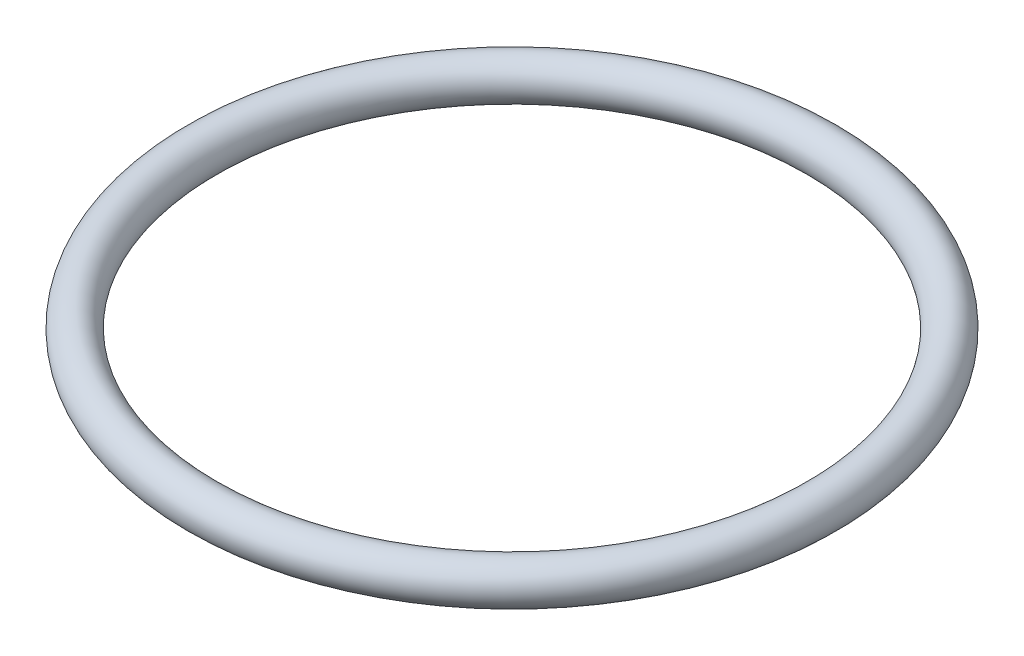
ISO-10303-21;
HEADER;
FILE_DESCRIPTION(('STEP AP214'),'2;1');
FILE_NAME('part.step','',(''),(''),'','','');
FILE_SCHEMA(('AUTOMOTIVE_DESIGN { 1 0 10303 214 1 1 1 1 }'));
ENDSEC;
DATA;
#1=APPLICATION_CONTEXT('core data for automotive mechanical design processes');
#2=APPLICATION_PROTOCOL_DEFINITION('international standard','automotive_design',2000,#1);
#3=PRODUCT_CONTEXT('',#1,'mechanical');
#4=PRODUCT('Part','Part','',(#3));
#5=PRODUCT_RELATED_PRODUCT_CATEGORY('part','',(#4));
#6=PRODUCT_DEFINITION_FORMATION('','',#4);
#7=PRODUCT_DEFINITION_CONTEXT('part definition',#1,'design');
#8=PRODUCT_DEFINITION('design','',#6,#7);
#9=PRODUCT_DEFINITION_SHAPE('','',#8);
#10=(LENGTH_UNIT() NAMED_UNIT(*) SI_UNIT(.MILLI.,.METRE.));
#11=(NAMED_UNIT(*) PLANE_ANGLE_UNIT() SI_UNIT($,.RADIAN.));
#12=(NAMED_UNIT(*) SI_UNIT($,.STERADIAN.) SOLID_ANGLE_UNIT());
#13=UNCERTAINTY_MEASURE_WITH_UNIT(LENGTH_MEASURE(1.E-05),#10,'distance_accuracy_value','');
#14=(GEOMETRIC_REPRESENTATION_CONTEXT(3) GLOBAL_UNCERTAINTY_ASSIGNED_CONTEXT((#13)) GLOBAL_UNIT_ASSIGNED_CONTEXT((#10,
#11,#12)) REPRESENTATION_CONTEXT('',''));
#15=CARTESIAN_POINT('',(0.,0.,0.));
#16=DIRECTION('',(0.,0.,1.));
#17=DIRECTION('',(1.,0.,0.));
#18=AXIS2_PLACEMENT_3D('',#15,#16,#17);
#19=CARTESIAN_POINT('',(0.,0.,0.));
#20=DIRECTION('',(0.,-1.,0.));
#21=DIRECTION('',(0.,0.,-1.));
#22=AXIS2_PLACEMENT_3D('',#19,#20,#21);
#23=TOROIDAL_SURFACE('',#22,7.747,0.508);
#24=CARTESIAN_POINT('',(0.,0.,-8.255));
#25=VERTEX_POINT('',#24);
#26=VERTEX_LOOP('',#25);
#27=FACE_BOUND('',#26,.T.);
#28=ADVANCED_FACE('F22',(#27),#23,.T.);
#29=CLOSED_SHELL('',(#28));
#30=MANIFOLD_SOLID_BREP('B2',#29);
#31=ADVANCED_BREP_SHAPE_REPRESENTATION('',(#18,#30),#14);
#32=SHAPE_DEFINITION_REPRESENTATION(#9,#31);
ENDSEC;
END-ISO-10303-21;
